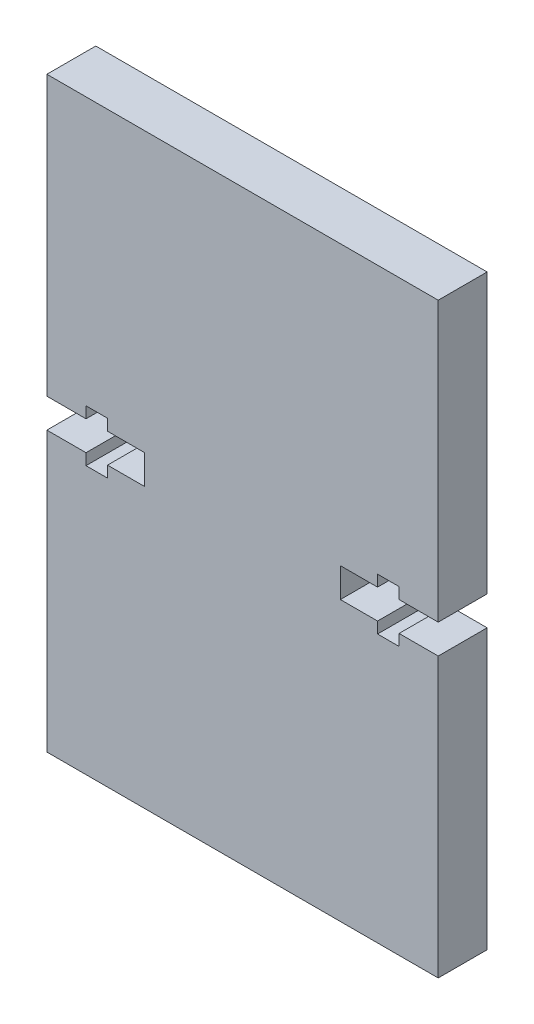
ISO-10303-21;
HEADER;
FILE_DESCRIPTION(('STEP AP214'),'2;1');
FILE_NAME('part.step','',(''),(''),'','','');
FILE_SCHEMA(('AUTOMOTIVE_DESIGN { 1 0 10303 214 1 1 1 1 }'));
ENDSEC;
DATA;
#1=APPLICATION_CONTEXT('core data for automotive mechanical design processes');
#2=APPLICATION_PROTOCOL_DEFINITION('international standard','automotive_design',2000,#1);
#3=PRODUCT_CONTEXT('',#1,'mechanical');
#4=PRODUCT('Part','Part','',(#3));
#5=PRODUCT_RELATED_PRODUCT_CATEGORY('part','',(#4));
#6=PRODUCT_DEFINITION_FORMATION('','',#4);
#7=PRODUCT_DEFINITION_CONTEXT('part definition',#1,'design');
#8=PRODUCT_DEFINITION('design','',#6,#7);
#9=PRODUCT_DEFINITION_SHAPE('','',#8);
#10=(LENGTH_UNIT() NAMED_UNIT(*) SI_UNIT(.MILLI.,.METRE.));
#11=(NAMED_UNIT(*) PLANE_ANGLE_UNIT() SI_UNIT($,.RADIAN.));
#12=(NAMED_UNIT(*) SI_UNIT($,.STERADIAN.) SOLID_ANGLE_UNIT());
#13=UNCERTAINTY_MEASURE_WITH_UNIT(LENGTH_MEASURE(1.E-05),#10,'distance_accuracy_value','');
#14=(GEOMETRIC_REPRESENTATION_CONTEXT(3) GLOBAL_UNCERTAINTY_ASSIGNED_CONTEXT((#13)) GLOBAL_UNIT_ASSIGNED_CONTEXT((#10,
#11,#12)) REPRESENTATION_CONTEXT('',''));
#15=CARTESIAN_POINT('',(0.,0.,0.));
#16=DIRECTION('',(0.,0.,1.));
#17=DIRECTION('',(1.,0.,0.));
#18=AXIS2_PLACEMENT_3D('',#15,#16,#17);
#19=CARTESIAN_POINT('',(-13.7999999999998,0.,10.));
#20=DIRECTION('',(1.,0.,0.));
#21=DIRECTION('',(0.,0.,-1.));
#22=AXIS2_PLACEMENT_3D('',#19,#20,#21);
#23=PLANE('',#22);
#24=DIRECTION('',(0.,0.,1.));
#25=VECTOR('',#24,1.);
#26=CARTESIAN_POINT('',(-13.7999999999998,2.64999999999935,10.));
#27=LINE('',#26,#25);
#28=CARTESIAN_POINT('',(-13.7999999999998,2.64999999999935,5.));
#29=VERTEX_POINT('',#28);
#30=CARTESIAN_POINT('',(-13.7999999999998,2.64999999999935,0.));
#31=VERTEX_POINT('',#30);
#32=EDGE_CURVE('E206',#29,#31,#27,.F.);
#33=ORIENTED_EDGE('',*,*,#32,.T.);
#34=DIRECTION('',(0.,1.,0.));
#35=VECTOR('',#34,1.);
#36=CARTESIAN_POINT('',(-13.7999999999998,0.,0.));
#37=LINE('',#36,#35);
#38=CARTESIAN_POINT('',(-13.7999999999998,1.49999999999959,0.));
#39=VERTEX_POINT('',#38);
#40=EDGE_CURVE('E20',#39,#31,#37,.T.);
#41=ORIENTED_EDGE('',*,*,#40,.F.);
#42=DIRECTION('',(0.,0.,1.));
#43=VECTOR('',#42,1.);
#44=CARTESIAN_POINT('',(-13.7999999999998,1.49999999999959,10.));
#45=LINE('',#44,#43);
#46=CARTESIAN_POINT('',(-13.7999999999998,1.49999999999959,5.));
#47=VERTEX_POINT('',#46);
#48=EDGE_CURVE('E220',#39,#47,#45,.T.);
#49=ORIENTED_EDGE('',*,*,#48,.T.);
#50=DIRECTION('',(0.,1.,0.));
#51=VECTOR('',#50,1.);
#52=CARTESIAN_POINT('',(-13.7999999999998,0.,5.));
#53=LINE('',#52,#51);
#54=EDGE_CURVE('E218',#29,#47,#53,.F.);
#55=ORIENTED_EDGE('',*,*,#54,.F.);
#56=EDGE_LOOP('',(#33,#41,#49,#55));
#57=FACE_BOUND('',#56,.T.);
#58=ADVANCED_FACE('F17',(#57),#23,.F.);
#59=CARTESIAN_POINT('',(-13.7999999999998,-1.50000000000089,10.));
#60=DIRECTION('',(1.,0.,0.));
#61=DIRECTION('',(0.,0.,-1.));
#62=AXIS2_PLACEMENT_3D('',#59,#60,#61);
#63=PLANE('',#62);
#64=DIRECTION('',(0.,0.,1.));
#65=VECTOR('',#64,1.);
#66=CARTESIAN_POINT('',(-13.7999999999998,-1.50000000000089,10.));
#67=LINE('',#66,#65);
#68=CARTESIAN_POINT('',(-13.7999999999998,-1.50000000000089,5.));
#69=VERTEX_POINT('',#68);
#70=CARTESIAN_POINT('',(-13.7999999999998,-1.50000000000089,0.));
#71=VERTEX_POINT('',#70);
#72=EDGE_CURVE('E270',#69,#71,#67,.F.);
#73=ORIENTED_EDGE('',*,*,#72,.T.);
#74=DIRECTION('',(0.,1.,0.));
#75=VECTOR('',#74,1.);
#76=CARTESIAN_POINT('',(-13.7999999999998,-1.50000000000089,0.));
#77=LINE('',#76,#75);
#78=CARTESIAN_POINT('',(-13.7999999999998,-2.65000000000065,0.));
#79=VERTEX_POINT('',#78);
#80=EDGE_CURVE('E252',#79,#71,#77,.T.);
#81=ORIENTED_EDGE('',*,*,#80,.F.);
#82=DIRECTION('',(0.,0.,1.));
#83=VECTOR('',#82,1.);
#84=CARTESIAN_POINT('',(-13.7999999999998,-2.65000000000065,10.));
#85=LINE('',#84,#83);
#86=CARTESIAN_POINT('',(-13.7999999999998,-2.65000000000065,5.));
#87=VERTEX_POINT('',#86);
#88=EDGE_CURVE('E281',#79,#87,#85,.T.);
#89=ORIENTED_EDGE('',*,*,#88,.T.);
#90=DIRECTION('',(0.,1.,0.));
#91=VECTOR('',#90,1.);
#92=CARTESIAN_POINT('',(-13.7999999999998,0.,5.));
#93=LINE('',#92,#91);
#94=EDGE_CURVE('E222',#69,#87,#93,.F.);
#95=ORIENTED_EDGE('',*,*,#94,.F.);
#96=EDGE_LOOP('',(#73,#81,#89,#95));
#97=FACE_BOUND('',#96,.T.);
#98=ADVANCED_FACE('F512',(#97),#63,.F.);
#99=CARTESIAN_POINT('',(-15.9999999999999,-2.65000000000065,10.));
#100=DIRECTION('',(-1.,1.02574953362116E-13,0.));
#101=DIRECTION('',(-1.02574953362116E-13,-1.,0.));
#102=AXIS2_PLACEMENT_3D('',#99,#100,#101);
#103=PLANE('',#102);
#104=DIRECTION('',(0.,0.,1.));
#105=VECTOR('',#104,1.);
#106=CARTESIAN_POINT('',(-15.9999999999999,-2.65000000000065,10.));
#107=LINE('',#106,#105);
#108=CARTESIAN_POINT('',(-15.9999999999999,-2.65000000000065,5.));
#109=VERTEX_POINT('',#108);
#110=CARTESIAN_POINT('',(-15.9999999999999,-2.65000000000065,0.));
#111=VERTEX_POINT('',#110);
#112=EDGE_CURVE('E278',#109,#111,#107,.F.);
#113=ORIENTED_EDGE('',*,*,#112,.T.);
#114=DIRECTION('',(-1.02574953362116E-13,-1.,0.));
#115=VECTOR('',#114,1.);
#116=CARTESIAN_POINT('',(-15.9999999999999,-2.65000000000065,0.));
#117=LINE('',#116,#115);
#118=CARTESIAN_POINT('',(-15.9999999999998,-1.50000000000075,0.));
#119=VERTEX_POINT('',#118);
#120=EDGE_CURVE('E251',#119,#111,#117,.T.);
#121=ORIENTED_EDGE('',*,*,#120,.F.);
#122=DIRECTION('',(0.,0.,1.));
#123=VECTOR('',#122,1.);
#124=CARTESIAN_POINT('',(-15.9999999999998,-1.50000000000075,10.));
#125=LINE('',#124,#123);
#126=CARTESIAN_POINT('',(-15.9999999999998,-1.50000000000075,5.));
#127=VERTEX_POINT('',#126);
#128=EDGE_CURVE('E287',#119,#127,#125,.T.);
#129=ORIENTED_EDGE('',*,*,#128,.T.);
#130=DIRECTION('',(0.,1.,0.));
#131=VECTOR('',#130,1.);
#132=CARTESIAN_POINT('',(-15.9999999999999,0.,5.));
#133=LINE('',#132,#131);
#134=EDGE_CURVE('E238',#109,#127,#133,.T.);
#135=ORIENTED_EDGE('',*,*,#134,.F.);
#136=EDGE_LOOP('',(#113,#121,#129,#135));
#137=FACE_BOUND('',#136,.T.);
#138=ADVANCED_FACE('F505',(#137),#103,.F.);
#139=CARTESIAN_POINT('',(15.9999999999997,1.54465812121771E-12,10.));
#140=DIRECTION('',(-1.,0.,0.));
#141=DIRECTION('',(0.,-1.,0.));
#142=AXIS2_PLACEMENT_3D('',#139,#140,#141);
#143=PLANE('',#142);
#144=DIRECTION('',(0.,0.,1.));
#145=VECTOR('',#144,1.);
#146=CARTESIAN_POINT('',(16.,-2.65000000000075,10.));
#147=LINE('',#146,#145);
#148=CARTESIAN_POINT('',(15.9999999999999,-2.65000000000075,5.));
#149=VERTEX_POINT('',#148);
#150=CARTESIAN_POINT('',(15.9999999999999,-2.65000000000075,0.));
#151=VERTEX_POINT('',#150);
#152=EDGE_CURVE('E314',#149,#151,#147,.F.);
#153=ORIENTED_EDGE('',*,*,#152,.F.);
#154=DIRECTION('',(0.,1.,0.));
#155=VECTOR('',#154,1.);
#156=CARTESIAN_POINT('',(15.9999999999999,0.,5.));
#157=LINE('',#156,#155);
#158=CARTESIAN_POINT('',(15.9999999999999,-1.50000000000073,5.));
#159=VERTEX_POINT('',#158);
#160=EDGE_CURVE('E236',#159,#149,#157,.F.);
#161=ORIENTED_EDGE('',*,*,#160,.F.);
#162=DIRECTION('',(0.,0.,1.));
#163=VECTOR('',#162,1.);
#164=CARTESIAN_POINT('',(15.9999999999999,-1.50000000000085,10.));
#165=LINE('',#164,#163);
#166=CARTESIAN_POINT('',(15.9999999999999,-1.50000000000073,0.));
#167=VERTEX_POINT('',#166);
#168=EDGE_CURVE('E309',#167,#159,#165,.T.);
#169=ORIENTED_EDGE('',*,*,#168,.F.);
#170=DIRECTION('',(0.,-1.,0.));
#171=VECTOR('',#170,1.);
#172=CARTESIAN_POINT('',(15.9999999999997,1.54465812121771E-12,0.));
#173=LINE('',#172,#171);
#174=EDGE_CURVE('E249',#167,#151,#173,.T.);
#175=ORIENTED_EDGE('',*,*,#174,.T.);
#176=EDGE_LOOP('',(#153,#161,#169,#175));
#177=FACE_BOUND('',#176,.T.);
#178=ADVANCED_FACE('F480',(#177),#143,.T.);
#179=CARTESIAN_POINT('',(13.8,0.,10.));
#180=DIRECTION('',(1.,0.,0.));
#181=DIRECTION('',(0.,1.,0.));
#182=AXIS2_PLACEMENT_3D('',#179,#180,#181);
#183=PLANE('',#182);
#184=DIRECTION('',(0.,0.,1.));
#185=VECTOR('',#184,1.);
#186=CARTESIAN_POINT('',(13.7999999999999,-1.50000000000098,10.));
#187=LINE('',#186,#185);
#188=CARTESIAN_POINT('',(13.7999999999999,-1.50000000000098,5.));
#189=VERTEX_POINT('',#188);
#190=CARTESIAN_POINT('',(13.7999999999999,-1.50000000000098,0.));
#191=VERTEX_POINT('',#190);
#192=EDGE_CURVE('E322',#189,#191,#187,.F.);
#193=ORIENTED_EDGE('',*,*,#192,.F.);
#194=DIRECTION('',(0.,1.,0.));
#195=VECTOR('',#194,1.);
#196=CARTESIAN_POINT('',(13.7999999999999,0.,5.));
#197=LINE('',#196,#195);
#198=CARTESIAN_POINT('',(13.7999999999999,-2.65000000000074,5.));
#199=VERTEX_POINT('',#198);
#200=EDGE_CURVE('E234',#199,#189,#197,.T.);
#201=ORIENTED_EDGE('',*,*,#200,.F.);
#202=DIRECTION('',(0.,0.,1.));
#203=VECTOR('',#202,1.);
#204=CARTESIAN_POINT('',(13.7999999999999,-2.65000000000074,10.));
#205=LINE('',#204,#203);
#206=CARTESIAN_POINT('',(13.7999999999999,-2.65000000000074,0.));
#207=VERTEX_POINT('',#206);
#208=EDGE_CURVE('E317',#207,#199,#205,.T.);
#209=ORIENTED_EDGE('',*,*,#208,.F.);
#210=DIRECTION('',(0.,1.,0.));
#211=VECTOR('',#210,1.);
#212=CARTESIAN_POINT('',(13.8,0.,0.));
#213=LINE('',#212,#211);
#214=EDGE_CURVE('E247',#207,#191,#213,.T.);
#215=ORIENTED_EDGE('',*,*,#214,.T.);
#216=EDGE_LOOP('',(#193,#201,#209,#215));
#217=FACE_BOUND('',#216,.T.);
#218=ADVANCED_FACE('F473',(#217),#183,.T.);
#219=CARTESIAN_POINT('',(13.8,0.,10.));
#220=DIRECTION('',(1.,0.,0.));
#221=DIRECTION('',(0.,1.,0.));
#222=AXIS2_PLACEMENT_3D('',#219,#220,#221);
#223=PLANE('',#222);
#224=DIRECTION('',(0.,0.,1.));
#225=VECTOR('',#224,1.);
#226=CARTESIAN_POINT('',(13.8,2.64999999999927,10.));
#227=LINE('',#226,#225);
#228=CARTESIAN_POINT('',(13.8,2.64999999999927,5.));
#229=VERTEX_POINT('',#228);
#230=CARTESIAN_POINT('',(13.8,2.64999999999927,0.));
#231=VERTEX_POINT('',#230);
#232=EDGE_CURVE('E340',#229,#231,#227,.F.);
#233=ORIENTED_EDGE('',*,*,#232,.F.);
#234=DIRECTION('',(0.,1.,0.));
#235=VECTOR('',#234,1.);
#236=CARTESIAN_POINT('',(13.8,0.,5.));
#237=LINE('',#236,#235);
#238=CARTESIAN_POINT('',(13.8,1.49999999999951,5.));
#239=VERTEX_POINT('',#238);
#240=EDGE_CURVE('E232',#239,#229,#237,.T.);
#241=ORIENTED_EDGE('',*,*,#240,.F.);
#242=DIRECTION('',(0.,0.,1.));
#243=VECTOR('',#242,1.);
#244=CARTESIAN_POINT('',(13.8,1.49999999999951,10.));
#245=LINE('',#244,#243);
#246=CARTESIAN_POINT('',(13.8,1.49999999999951,0.));
#247=VERTEX_POINT('',#246);
#248=EDGE_CURVE('E335',#247,#239,#245,.T.);
#249=ORIENTED_EDGE('',*,*,#248,.F.);
#250=DIRECTION('',(0.,1.,0.));
#251=VECTOR('',#250,1.);
#252=CARTESIAN_POINT('',(13.8,0.,0.));
#253=LINE('',#252,#251);
#254=EDGE_CURVE('E245',#247,#231,#253,.T.);
#255=ORIENTED_EDGE('',*,*,#254,.T.);
#256=EDGE_LOOP('',(#233,#241,#249,#255));
#257=FACE_BOUND('',#256,.T.);
#258=ADVANCED_FACE('F456',(#257),#223,.T.);
#259=CARTESIAN_POINT('',(15.9999999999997,-1.73774038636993E-12,10.));
#260=DIRECTION('',(-1.,1.08608774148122E-13,0.));
#261=DIRECTION('',(-1.08608774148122E-13,-1.,0.));
#262=AXIS2_PLACEMENT_3D('',#259,#260,#261);
#263=PLANE('',#262);
#264=DIRECTION('',(0.,0.,1.));
#265=VECTOR('',#264,1.);
#266=CARTESIAN_POINT('',(15.9999999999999,1.49999999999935,10.));
#267=LINE('',#266,#265);
#268=CARTESIAN_POINT('',(15.9999999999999,1.49999999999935,5.));
#269=VERTEX_POINT('',#268);
#270=CARTESIAN_POINT('',(15.9999999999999,1.49999999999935,0.));
#271=VERTEX_POINT('',#270);
#272=EDGE_CURVE('E348',#269,#271,#267,.F.);
#273=ORIENTED_EDGE('',*,*,#272,.F.);
#274=DIRECTION('',(0.,1.,0.));
#275=VECTOR('',#274,1.);
#276=CARTESIAN_POINT('',(16.,0.,5.));
#277=LINE('',#276,#275);
#278=CARTESIAN_POINT('',(16.,2.64999999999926,5.));
#279=VERTEX_POINT('',#278);
#280=EDGE_CURVE('E215',#279,#269,#277,.F.);
#281=ORIENTED_EDGE('',*,*,#280,.F.);
#282=DIRECTION('',(0.,0.,1.));
#283=VECTOR('',#282,1.);
#284=CARTESIAN_POINT('',(16.,2.64999999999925,10.));
#285=LINE('',#284,#283);
#286=CARTESIAN_POINT('',(16.,2.64999999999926,0.));
#287=VERTEX_POINT('',#286);
#288=EDGE_CURVE('E343',#287,#279,#285,.T.);
#289=ORIENTED_EDGE('',*,*,#288,.F.);
#290=DIRECTION('',(-1.08608774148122E-13,-1.,0.));
#291=VECTOR('',#290,1.);
#292=CARTESIAN_POINT('',(15.9999999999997,-1.73774038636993E-12,0.));
#293=LINE('',#292,#291);
#294=EDGE_CURVE('E243',#287,#271,#293,.T.);
#295=ORIENTED_EDGE('',*,*,#294,.T.);
#296=EDGE_LOOP('',(#273,#281,#289,#295));
#297=FACE_BOUND('',#296,.T.);
#298=ADVANCED_FACE('F445',(#297),#263,.T.);
#299=CARTESIAN_POINT('',(-15.9999999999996,-1.64119925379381E-12,10.));
#300=DIRECTION('',(-1.,-1.02574953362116E-13,0.));
#301=DIRECTION('',(1.02574953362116E-13,-1.,0.));
#302=AXIS2_PLACEMENT_3D('',#299,#300,#301);
#303=PLANE('',#302);
#304=DIRECTION('',(0.,0.,1.));
#305=VECTOR('',#304,1.);
#306=CARTESIAN_POINT('',(-15.9999999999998,1.49999999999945,10.));
#307=LINE('',#306,#305);
#308=CARTESIAN_POINT('',(-15.9999999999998,1.49999999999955,5.));
#309=VERTEX_POINT('',#308);
#310=CARTESIAN_POINT('',(-15.9999999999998,1.49999999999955,0.));
#311=VERTEX_POINT('',#310);
#312=EDGE_CURVE('E369',#309,#311,#307,.F.);
#313=ORIENTED_EDGE('',*,*,#312,.T.);
#314=DIRECTION('',(1.02574953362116E-13,-1.,0.));
#315=VECTOR('',#314,1.);
#316=CARTESIAN_POINT('',(-15.9999999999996,-1.64119925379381E-12,0.));
#317=LINE('',#316,#315);
#318=CARTESIAN_POINT('',(-15.9999999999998,2.64999999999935,0.));
#319=VERTEX_POINT('',#318);
#320=EDGE_CURVE('E35',#319,#311,#317,.T.);
#321=ORIENTED_EDGE('',*,*,#320,.F.);
#322=DIRECTION('',(0.,0.,1.));
#323=VECTOR('',#322,1.);
#324=CARTESIAN_POINT('',(-15.9999999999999,2.64999999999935,10.));
#325=LINE('',#324,#323);
#326=CARTESIAN_POINT('',(-15.9999999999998,2.64999999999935,5.));
#327=VERTEX_POINT('',#326);
#328=EDGE_CURVE('E214',#319,#327,#325,.T.);
#329=ORIENTED_EDGE('',*,*,#328,.T.);
#330=DIRECTION('',(0.,1.,0.));
#331=VECTOR('',#330,1.);
#332=CARTESIAN_POINT('',(-15.9999999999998,0.,5.));
#333=LINE('',#332,#331);
#334=EDGE_CURVE('E200',#309,#327,#333,.T.);
#335=ORIENTED_EDGE('',*,*,#334,.F.);
#336=EDGE_LOOP('',(#313,#321,#329,#335));
#337=FACE_BOUND('',#336,.T.);
#338=ADVANCED_FACE('F694',(#337),#303,.F.);
#339=CARTESIAN_POINT('',(0.,0.,5.));
#340=DIRECTION('',(0.,0.,1.));
#341=DIRECTION('',(1.,0.,0.));
#342=AXIS2_PLACEMENT_3D('',#339,#340,#341);
#343=PLANE('',#342);
#344=DIRECTION('',(1.,0.,0.));
#345=VECTOR('',#344,1.);
#346=CARTESIAN_POINT('',(-20.0000000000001,30.,5.));
#347=LINE('',#346,#345);
#348=CARTESIAN_POINT('',(19.9999999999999,30.,5.));
#349=VERTEX_POINT('',#348);
#350=CARTESIAN_POINT('',(-20.0000000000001,30.,5.));
#351=VERTEX_POINT('',#350);
#352=EDGE_CURVE('E362',#349,#351,#347,.F.);
#353=ORIENTED_EDGE('',*,*,#352,.T.);
#354=DIRECTION('',(0.,1.,0.));
#355=VECTOR('',#354,1.);
#356=CARTESIAN_POINT('',(-20.0000000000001,30.,5.));
#357=LINE('',#356,#355);
#358=CARTESIAN_POINT('',(-20.0000000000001,1.49999999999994,5.));
#359=VERTEX_POINT('',#358);
#360=EDGE_CURVE('E367',#351,#359,#357,.F.);
#361=ORIENTED_EDGE('',*,*,#360,.T.);
#362=DIRECTION('',(-1.,1.97541635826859E-13,0.));
#363=VECTOR('',#362,1.);
#364=CARTESIAN_POINT('',(2.96312453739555E-13,1.49999999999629,5.));
#365=LINE('',#364,#363);
#366=EDGE_CURVE('E374',#359,#309,#365,.F.);
#367=ORIENTED_EDGE('',*,*,#366,.T.);
#368=ORIENTED_EDGE('',*,*,#334,.T.);
#369=DIRECTION('',(1.,0.,0.));
#370=VECTOR('',#369,1.);
#371=CARTESIAN_POINT('',(0.,2.64999999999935,5.));
#372=LINE('',#371,#370);
#373=EDGE_CURVE('E210',#327,#29,#372,.T.);
#374=ORIENTED_EDGE('',*,*,#373,.T.);
#375=ORIENTED_EDGE('',*,*,#54,.T.);
#376=DIRECTION('',(1.,0.,0.));
#377=VECTOR('',#376,1.);
#378=CARTESIAN_POINT('',(0.,1.49999999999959,5.));
#379=LINE('',#378,#377);
#380=CARTESIAN_POINT('',(-9.99999999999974,1.49999999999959,5.));
#381=VERTEX_POINT('',#380);
#382=EDGE_CURVE('E226',#47,#381,#379,.T.);
#383=ORIENTED_EDGE('',*,*,#382,.T.);
#384=DIRECTION('',(0.,1.,0.));
#385=VECTOR('',#384,1.);
#386=CARTESIAN_POINT('',(-9.99999999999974,0.,5.));
#387=LINE('',#386,#385);
#388=CARTESIAN_POINT('',(-9.99999999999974,-1.50000000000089,5.));
#389=VERTEX_POINT('',#388);
#390=EDGE_CURVE('E266',#381,#389,#387,.F.);
#391=ORIENTED_EDGE('',*,*,#390,.T.);
#392=DIRECTION('',(1.,0.,0.));
#393=VECTOR('',#392,1.);
#394=CARTESIAN_POINT('',(-9.99999999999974,-1.50000000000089,5.));
#395=LINE('',#394,#393);
#396=EDGE_CURVE('E275',#389,#69,#395,.F.);
#397=ORIENTED_EDGE('',*,*,#396,.T.);
#398=ORIENTED_EDGE('',*,*,#94,.T.);
#399=DIRECTION('',(1.,0.,0.));
#400=VECTOR('',#399,1.);
#401=CARTESIAN_POINT('',(-13.7999999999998,-2.65000000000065,5.));
#402=LINE('',#401,#400);
#403=EDGE_CURVE('E284',#87,#109,#402,.F.);
#404=ORIENTED_EDGE('',*,*,#403,.T.);
#405=ORIENTED_EDGE('',*,*,#134,.T.);
#406=DIRECTION('',(1.,-1.28261117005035E-13,0.));
#407=VECTOR('',#406,1.);
#408=CARTESIAN_POINT('',(-15.9999999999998,-1.50000000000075,5.));
#409=LINE('',#408,#407);
#410=CARTESIAN_POINT('',(-19.9999999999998,-1.50000000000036,5.));
#411=VERTEX_POINT('',#410);
#412=EDGE_CURVE('E290',#127,#411,#409,.F.);
#413=ORIENTED_EDGE('',*,*,#412,.T.);
#414=DIRECTION('',(0.,1.,0.));
#415=VECTOR('',#414,1.);
#416=CARTESIAN_POINT('',(-20.0000000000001,30.,5.));
#417=LINE('',#416,#415);
#418=CARTESIAN_POINT('',(-20.,-30.,5.));
#419=VERTEX_POINT('',#418);
#420=EDGE_CURVE('E295',#411,#419,#417,.F.);
#421=ORIENTED_EDGE('',*,*,#420,.T.);
#422=DIRECTION('',(1.,0.,0.));
#423=VECTOR('',#422,1.);
#424=CARTESIAN_POINT('',(-20.,-30.,5.));
#425=LINE('',#424,#423);
#426=CARTESIAN_POINT('',(20.,-30.,5.));
#427=VERTEX_POINT('',#426);
#428=EDGE_CURVE('E300',#419,#427,#425,.T.);
#429=ORIENTED_EDGE('',*,*,#428,.T.);
#430=DIRECTION('',(0.,-1.,0.));
#431=VECTOR('',#430,1.);
#432=CARTESIAN_POINT('',(19.9999999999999,30.,5.));
#433=LINE('',#432,#431);
#434=CARTESIAN_POINT('',(20.,-1.50000000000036,5.));
#435=VERTEX_POINT('',#434);
#436=EDGE_CURVE('E305',#427,#435,#433,.F.);
#437=ORIENTED_EDGE('',*,*,#436,.T.);
#438=DIRECTION('',(-1.,-1.23056946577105E-13,0.));
#439=VECTOR('',#438,1.);
#440=CARTESIAN_POINT('',(1.84585419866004E-13,-1.50000000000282,5.));
#441=LINE('',#440,#439);
#442=EDGE_CURVE('E311',#159,#435,#441,.F.);
#443=ORIENTED_EDGE('',*,*,#442,.F.);
#444=ORIENTED_EDGE('',*,*,#160,.T.);
#445=DIRECTION('',(-1.,0.,0.));
#446=VECTOR('',#445,1.);
#447=CARTESIAN_POINT('',(0.,-2.65000000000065,5.));
#448=LINE('',#447,#446);
#449=EDGE_CURVE('E319',#199,#149,#448,.F.);
#450=ORIENTED_EDGE('',*,*,#449,.F.);
#451=ORIENTED_EDGE('',*,*,#200,.T.);
#452=DIRECTION('',(-1.,0.,0.));
#453=VECTOR('',#452,1.);
#454=CARTESIAN_POINT('',(0.,-1.50000000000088,5.));
#455=LINE('',#454,#453);
#456=CARTESIAN_POINT('',(9.99999999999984,-1.50000000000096,5.));
#457=VERTEX_POINT('',#456);
#458=EDGE_CURVE('E325',#457,#189,#455,.F.);
#459=ORIENTED_EDGE('',*,*,#458,.F.);
#460=DIRECTION('',(0.,1.,0.));
#461=VECTOR('',#460,1.);
#462=CARTESIAN_POINT('',(9.99999999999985,0.,5.));
#463=LINE('',#462,#461);
#464=CARTESIAN_POINT('',(9.99999999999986,1.49999999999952,5.));
#465=VERTEX_POINT('',#464);
#466=EDGE_CURVE('E330',#465,#457,#463,.F.);
#467=ORIENTED_EDGE('',*,*,#466,.F.);
#468=DIRECTION('',(1.,0.,0.));
#469=VECTOR('',#468,1.);
#470=CARTESIAN_POINT('',(0.,1.49999999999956,5.));
#471=LINE('',#470,#469);
#472=EDGE_CURVE('E337',#239,#465,#471,.F.);
#473=ORIENTED_EDGE('',*,*,#472,.F.);
#474=ORIENTED_EDGE('',*,*,#240,.T.);
#475=DIRECTION('',(1.,0.,0.));
#476=VECTOR('',#475,1.);
#477=CARTESIAN_POINT('',(0.,2.64999999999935,5.));
#478=LINE('',#477,#476);
#479=EDGE_CURVE('E345',#279,#229,#478,.F.);
#480=ORIENTED_EDGE('',*,*,#479,.F.);
#481=ORIENTED_EDGE('',*,*,#280,.T.);
#482=DIRECTION('',(1.,1.90602741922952E-13,0.));
#483=VECTOR('',#482,1.);
#484=CARTESIAN_POINT('',(-2.85904112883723E-13,1.4999999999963,5.));
#485=LINE('',#484,#483);
#486=CARTESIAN_POINT('',(20.,1.49999999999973,5.));
#487=VERTEX_POINT('',#486);
#488=EDGE_CURVE('E351',#487,#269,#485,.F.);
#489=ORIENTED_EDGE('',*,*,#488,.F.);
#490=DIRECTION('',(0.,-1.,0.));
#491=VECTOR('',#490,1.);
#492=CARTESIAN_POINT('',(19.9999999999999,30.,5.));
#493=LINE('',#492,#491);
#494=EDGE_CURVE('E354',#487,#349,#493,.F.);
#495=ORIENTED_EDGE('',*,*,#494,.T.);
#496=EDGE_LOOP('',(#353,#361,#367,#368,#374,#375,#383,#391,#397,#398,#404,#405,#413,#421,#429,
#437,#443,#444,#450,#451,#459,#467,#473,#474,#480,#481,#489,#495));
#497=FACE_BOUND('',#496,.T.);
#498=ADVANCED_FACE('F224',(#497),#343,.T.);
#499=CARTESIAN_POINT('',(0.,2.64999999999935,10.));
#500=DIRECTION('',(0.,1.,0.));
#501=DIRECTION('',(0.,0.,1.));
#502=AXIS2_PLACEMENT_3D('',#499,#500,#501);
#503=PLANE('',#502);
#504=ORIENTED_EDGE('',*,*,#328,.F.);
#505=DIRECTION('',(1.,0.,0.));
#506=VECTOR('',#505,1.);
#507=CARTESIAN_POINT('',(0.,2.64999999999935,0.));
#508=LINE('',#507,#506);
#509=EDGE_CURVE('E212',#319,#31,#508,.T.);
#510=ORIENTED_EDGE('',*,*,#509,.T.);
#511=ORIENTED_EDGE('',*,*,#32,.F.);
#512=ORIENTED_EDGE('',*,*,#373,.F.);
#513=EDGE_LOOP('',(#504,#510,#511,#512));
#514=FACE_BOUND('',#513,.T.);
#515=ADVANCED_FACE('F209',(#514),#503,.F.);
#516=CARTESIAN_POINT('',(0.,1.49999999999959,10.));
#517=DIRECTION('',(0.,1.,0.));
#518=DIRECTION('',(0.,0.,1.));
#519=AXIS2_PLACEMENT_3D('',#516,#517,#518);
#520=PLANE('',#519);
#521=ORIENTED_EDGE('',*,*,#48,.F.);
#522=DIRECTION('',(1.,0.,0.));
#523=VECTOR('',#522,1.);
#524=CARTESIAN_POINT('',(0.,1.49999999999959,0.));
#525=LINE('',#524,#523);
#526=CARTESIAN_POINT('',(-9.99999999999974,1.49999999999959,0.));
#527=VERTEX_POINT('',#526);
#528=EDGE_CURVE('E260',#39,#527,#525,.T.);
#529=ORIENTED_EDGE('',*,*,#528,.T.);
#530=DIRECTION('',(0.,0.,-1.));
#531=VECTOR('',#530,1.);
#532=CARTESIAN_POINT('',(-9.99999999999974,1.49999999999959,10.));
#533=LINE('',#532,#531);
#534=EDGE_CURVE('E264',#527,#381,#533,.F.);
#535=ORIENTED_EDGE('',*,*,#534,.T.);
#536=ORIENTED_EDGE('',*,*,#382,.F.);
#537=EDGE_LOOP('',(#521,#529,#535,#536));
#538=FACE_BOUND('',#537,.T.);
#539=ADVANCED_FACE('F262',(#538),#520,.F.);
#540=CARTESIAN_POINT('',(-9.99999999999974,0.,10.));
#541=DIRECTION('',(1.,0.,0.));
#542=DIRECTION('',(0.,0.,-1.));
#543=AXIS2_PLACEMENT_3D('',#540,#541,#542);
#544=PLANE('',#543);
#545=ORIENTED_EDGE('',*,*,#534,.F.);
#546=DIRECTION('',(0.,1.,0.));
#547=VECTOR('',#546,1.);
#548=CARTESIAN_POINT('',(-9.99999999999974,0.,0.));
#549=LINE('',#548,#547);
#550=CARTESIAN_POINT('',(-9.99999999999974,-1.50000000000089,0.));
#551=VERTEX_POINT('',#550);
#552=EDGE_CURVE('E378',#527,#551,#549,.F.);
#553=ORIENTED_EDGE('',*,*,#552,.T.);
#554=DIRECTION('',(0.,0.,1.));
#555=VECTOR('',#554,1.);
#556=CARTESIAN_POINT('',(-9.99999999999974,-1.50000000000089,10.));
#557=LINE('',#556,#555);
#558=EDGE_CURVE('E272',#551,#389,#557,.T.);
#559=ORIENTED_EDGE('',*,*,#558,.T.);
#560=ORIENTED_EDGE('',*,*,#390,.F.);
#561=EDGE_LOOP('',(#545,#553,#559,#560));
#562=FACE_BOUND('',#561,.T.);
#563=ADVANCED_FACE('F517',(#562),#544,.F.);
#564=CARTESIAN_POINT('',(-9.99999999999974,-1.50000000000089,10.));
#565=DIRECTION('',(0.,-1.,0.));
#566=DIRECTION('',(1.,0.,0.));
#567=AXIS2_PLACEMENT_3D('',#564,#565,#566);
#568=PLANE('',#567);
#569=ORIENTED_EDGE('',*,*,#558,.F.);
#570=DIRECTION('',(1.,0.,0.));
#571=VECTOR('',#570,1.);
#572=CARTESIAN_POINT('',(0.,-1.50000000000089,0.));
#573=LINE('',#572,#571);
#574=EDGE_CURVE('E381',#551,#71,#573,.F.);
#575=ORIENTED_EDGE('',*,*,#574,.T.);
#576=ORIENTED_EDGE('',*,*,#72,.F.);
#577=ORIENTED_EDGE('',*,*,#396,.F.);
#578=EDGE_LOOP('',(#569,#575,#576,#577));
#579=FACE_BOUND('',#578,.T.);
#580=ADVANCED_FACE('F515',(#579),#568,.F.);
#581=CARTESIAN_POINT('',(-13.7999999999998,-2.65000000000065,10.));
#582=DIRECTION('',(0.,-1.,0.));
#583=DIRECTION('',(1.,0.,0.));
#584=AXIS2_PLACEMENT_3D('',#581,#582,#583);
#585=PLANE('',#584);
#586=ORIENTED_EDGE('',*,*,#88,.F.);
#587=DIRECTION('',(1.,0.,0.));
#588=VECTOR('',#587,1.);
#589=CARTESIAN_POINT('',(0.,-2.65000000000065,0.));
#590=LINE('',#589,#588);
#591=EDGE_CURVE('E384',#79,#111,#590,.F.);
#592=ORIENTED_EDGE('',*,*,#591,.T.);
#593=ORIENTED_EDGE('',*,*,#112,.F.);
#594=ORIENTED_EDGE('',*,*,#403,.F.);
#595=EDGE_LOOP('',(#586,#592,#593,#594));
#596=FACE_BOUND('',#595,.T.);
#597=ADVANCED_FACE('F509',(#596),#585,.F.);
#598=CARTESIAN_POINT('',(-15.9999999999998,-1.50000000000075,10.));
#599=DIRECTION('',(-1.28261117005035E-13,-1.,0.));
#600=DIRECTION('',(1.,-1.28261117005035E-13,0.));
#601=AXIS2_PLACEMENT_3D('',#598,#599,#600);
#602=PLANE('',#601);
#603=ORIENTED_EDGE('',*,*,#128,.F.);
#604=DIRECTION('',(1.,0.,0.));
#605=VECTOR('',#604,1.);
#606=CARTESIAN_POINT('',(0.,-1.50000000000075,0.));
#607=LINE('',#606,#605);
#608=CARTESIAN_POINT('',(-19.9999999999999,-1.50000000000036,0.));
#609=VERTEX_POINT('',#608);
#610=EDGE_CURVE('E387',#119,#609,#607,.F.);
#611=ORIENTED_EDGE('',*,*,#610,.T.);
#612=DIRECTION('',(0.,0.,1.));
#613=VECTOR('',#612,1.);
#614=CARTESIAN_POINT('',(-20.,-1.50000000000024,5.));
#615=LINE('',#614,#613);
#616=EDGE_CURVE('E292',#609,#411,#615,.T.);
#617=ORIENTED_EDGE('',*,*,#616,.T.);
#618=ORIENTED_EDGE('',*,*,#412,.F.);
#619=EDGE_LOOP('',(#603,#611,#617,#618));
#620=FACE_BOUND('',#619,.T.);
#621=ADVANCED_FACE('F502',(#620),#602,.F.);
#622=CARTESIAN_POINT('',(-20.0000000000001,30.,5.));
#623=DIRECTION('',(1.,0.,0.));
#624=DIRECTION('',(0.,1.,0.));
#625=AXIS2_PLACEMENT_3D('',#622,#623,#624);
#626=PLANE('',#625);
#627=ORIENTED_EDGE('',*,*,#616,.F.);
#628=DIRECTION('',(0.,1.,0.));
#629=VECTOR('',#628,1.);
#630=CARTESIAN_POINT('',(-20.,0.,0.));
#631=LINE('',#630,#629);
#632=CARTESIAN_POINT('',(-20.,-30.,0.));
#633=VERTEX_POINT('',#632);
#634=EDGE_CURVE('E390',#609,#633,#631,.F.);
#635=ORIENTED_EDGE('',*,*,#634,.T.);
#636=DIRECTION('',(0.,0.,1.));
#637=VECTOR('',#636,1.);
#638=CARTESIAN_POINT('',(-20.,-30.,5.));
#639=LINE('',#638,#637);
#640=EDGE_CURVE('E297',#633,#419,#639,.T.);
#641=ORIENTED_EDGE('',*,*,#640,.T.);
#642=ORIENTED_EDGE('',*,*,#420,.F.);
#643=EDGE_LOOP('',(#627,#635,#641,#642));
#644=FACE_BOUND('',#643,.T.);
#645=ADVANCED_FACE('F497',(#644),#626,.F.);
#646=CARTESIAN_POINT('',(-20.,-30.,5.));
#647=DIRECTION('',(0.,1.,0.));
#648=DIRECTION('',(0.,0.,1.));
#649=AXIS2_PLACEMENT_3D('',#646,#647,#648);
#650=PLANE('',#649);
#651=DIRECTION('',(0.,0.,1.));
#652=VECTOR('',#651,1.);
#653=CARTESIAN_POINT('',(20.,-30.,5.));
#654=LINE('',#653,#652);
#655=CARTESIAN_POINT('',(20.,-30.,0.));
#656=VERTEX_POINT('',#655);
#657=EDGE_CURVE('E302',#656,#427,#654,.T.);
#658=ORIENTED_EDGE('',*,*,#657,.T.);
#659=ORIENTED_EDGE('',*,*,#428,.F.);
#660=ORIENTED_EDGE('',*,*,#640,.F.);
#661=DIRECTION('',(1.,0.,0.));
#662=VECTOR('',#661,1.);
#663=CARTESIAN_POINT('',(0.,-30.,0.));
#664=LINE('',#663,#662);
#665=EDGE_CURVE('E393',#633,#656,#664,.T.);
#666=ORIENTED_EDGE('',*,*,#665,.T.);
#667=EDGE_LOOP('',(#658,#659,#660,#666));
#668=FACE_BOUND('',#667,.T.);
#669=ADVANCED_FACE('F493',(#668),#650,.F.);
#670=CARTESIAN_POINT('',(19.9999999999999,30.,5.));
#671=DIRECTION('',(-1.,0.,0.));
#672=DIRECTION('',(0.,-1.,0.));
#673=AXIS2_PLACEMENT_3D('',#670,#671,#672);
#674=PLANE('',#673);
#675=ORIENTED_EDGE('',*,*,#436,.F.);
#676=ORIENTED_EDGE('',*,*,#657,.F.);
#677=DIRECTION('',(0.,1.,0.));
#678=VECTOR('',#677,1.);
#679=CARTESIAN_POINT('',(20.,0.,0.));
#680=LINE('',#679,#678);
#681=CARTESIAN_POINT('',(20.,-1.50000000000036,0.));
#682=VERTEX_POINT('',#681);
#683=EDGE_CURVE('E396',#656,#682,#680,.T.);
#684=ORIENTED_EDGE('',*,*,#683,.T.);
#685=DIRECTION('',(0.,0.,1.));
#686=VECTOR('',#685,1.);
#687=CARTESIAN_POINT('',(20.,-1.50000000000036,10.));
#688=LINE('',#687,#686);
#689=EDGE_CURVE('E307',#435,#682,#688,.F.);
#690=ORIENTED_EDGE('',*,*,#689,.F.);
#691=EDGE_LOOP('',(#675,#676,#684,#690));
#692=FACE_BOUND('',#691,.T.);
#693=ADVANCED_FACE('F490',(#692),#674,.F.);
#694=CARTESIAN_POINT('',(1.84585419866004E-13,-1.50000000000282,10.));
#695=DIRECTION('',(-1.23056946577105E-13,1.,0.));
#696=DIRECTION('',(-1.,-1.23056946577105E-13,0.));
#697=AXIS2_PLACEMENT_3D('',#694,#695,#696);
#698=PLANE('',#697);
#699=ORIENTED_EDGE('',*,*,#168,.T.);
#700=ORIENTED_EDGE('',*,*,#442,.T.);
#701=ORIENTED_EDGE('',*,*,#689,.T.);
#702=DIRECTION('',(1.,0.,0.));
#703=VECTOR('',#702,1.);
#704=CARTESIAN_POINT('',(0.,-1.50000000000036,0.));
#705=LINE('',#704,#703);
#706=EDGE_CURVE('E399',#682,#167,#705,.F.);
#707=ORIENTED_EDGE('',*,*,#706,.T.);
#708=EDGE_LOOP('',(#699,#700,#701,#707));
#709=FACE_BOUND('',#708,.T.);
#710=ADVANCED_FACE('F518',(#709),#698,.T.);
#711=CARTESIAN_POINT('',(0.,-2.65000000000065,10.));
#712=DIRECTION('',(0.,1.,0.));
#713=DIRECTION('',(-1.,0.,0.));
#714=AXIS2_PLACEMENT_3D('',#711,#712,#713);
#715=PLANE('',#714);
#716=ORIENTED_EDGE('',*,*,#208,.T.);
#717=ORIENTED_EDGE('',*,*,#449,.T.);
#718=ORIENTED_EDGE('',*,*,#152,.T.);
#719=DIRECTION('',(1.,0.,0.));
#720=VECTOR('',#719,1.);
#721=CARTESIAN_POINT('',(0.,-2.65000000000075,0.));
#722=LINE('',#721,#720);
#723=EDGE_CURVE('E402',#151,#207,#722,.F.);
#724=ORIENTED_EDGE('',*,*,#723,.T.);
#725=EDGE_LOOP('',(#716,#717,#718,#724));
#726=FACE_BOUND('',#725,.T.);
#727=ADVANCED_FACE('F476',(#726),#715,.T.);
#728=CARTESIAN_POINT('',(0.,-1.50000000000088,10.));
#729=DIRECTION('',(0.,1.,0.));
#730=DIRECTION('',(-1.,0.,0.));
#731=AXIS2_PLACEMENT_3D('',#728,#729,#730);
#732=PLANE('',#731);
#733=DIRECTION('',(0.,0.,1.));
#734=VECTOR('',#733,1.);
#735=CARTESIAN_POINT('',(9.99999999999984,-1.50000000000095,10.));
#736=LINE('',#735,#734);
#737=CARTESIAN_POINT('',(9.99999999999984,-1.50000000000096,0.));
#738=VERTEX_POINT('',#737);
#739=EDGE_CURVE('E328',#457,#738,#736,.F.);
#740=ORIENTED_EDGE('',*,*,#739,.F.);
#741=ORIENTED_EDGE('',*,*,#458,.T.);
#742=ORIENTED_EDGE('',*,*,#192,.T.);
#743=DIRECTION('',(1.,0.,0.));
#744=VECTOR('',#743,1.);
#745=CARTESIAN_POINT('',(0.,-1.50000000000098,0.));
#746=LINE('',#745,#744);
#747=EDGE_CURVE('E405',#191,#738,#746,.F.);
#748=ORIENTED_EDGE('',*,*,#747,.T.);
#749=EDGE_LOOP('',(#740,#741,#742,#748));
#750=FACE_BOUND('',#749,.T.);
#751=ADVANCED_FACE('F467',(#750),#732,.T.);
#752=CARTESIAN_POINT('',(9.99999999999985,0.,10.));
#753=DIRECTION('',(1.,0.,0.));
#754=DIRECTION('',(0.,1.,0.));
#755=AXIS2_PLACEMENT_3D('',#752,#753,#754);
#756=PLANE('',#755);
#757=DIRECTION('',(0.,0.,1.));
#758=VECTOR('',#757,1.);
#759=CARTESIAN_POINT('',(9.99999999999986,1.49999999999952,10.));
#760=LINE('',#759,#758);
#761=CARTESIAN_POINT('',(9.99999999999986,1.49999999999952,0.));
#762=VERTEX_POINT('',#761);
#763=EDGE_CURVE('E333',#465,#762,#760,.F.);
#764=ORIENTED_EDGE('',*,*,#763,.F.);
#765=ORIENTED_EDGE('',*,*,#466,.T.);
#766=ORIENTED_EDGE('',*,*,#739,.T.);
#767=DIRECTION('',(0.,1.,0.));
#768=VECTOR('',#767,1.);
#769=CARTESIAN_POINT('',(9.99999999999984,0.,0.));
#770=LINE('',#769,#768);
#771=EDGE_CURVE('E408',#738,#762,#770,.T.);
#772=ORIENTED_EDGE('',*,*,#771,.T.);
#773=EDGE_LOOP('',(#764,#765,#766,#772));
#774=FACE_BOUND('',#773,.T.);
#775=ADVANCED_FACE('F464',(#774),#756,.T.);
#776=CARTESIAN_POINT('',(0.,1.49999999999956,10.));
#777=DIRECTION('',(0.,-1.,0.));
#778=DIRECTION('',(1.,0.,0.));
#779=AXIS2_PLACEMENT_3D('',#776,#777,#778);
#780=PLANE('',#779);
#781=ORIENTED_EDGE('',*,*,#248,.T.);
#782=ORIENTED_EDGE('',*,*,#472,.T.);
#783=ORIENTED_EDGE('',*,*,#763,.T.);
#784=DIRECTION('',(1.,0.,0.));
#785=VECTOR('',#784,1.);
#786=CARTESIAN_POINT('',(0.,1.49999999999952,0.));
#787=LINE('',#786,#785);
#788=EDGE_CURVE('E411',#762,#247,#787,.T.);
#789=ORIENTED_EDGE('',*,*,#788,.T.);
#790=EDGE_LOOP('',(#781,#782,#783,#789));
#791=FACE_BOUND('',#790,.T.);
#792=ADVANCED_FACE('F459',(#791),#780,.T.);
#793=CARTESIAN_POINT('',(0.,2.64999999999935,10.));
#794=DIRECTION('',(0.,-1.,0.));
#795=DIRECTION('',(1.,0.,0.));
#796=AXIS2_PLACEMENT_3D('',#793,#794,#795);
#797=PLANE('',#796);
#798=ORIENTED_EDGE('',*,*,#288,.T.);
#799=ORIENTED_EDGE('',*,*,#479,.T.);
#800=ORIENTED_EDGE('',*,*,#232,.T.);
#801=DIRECTION('',(1.,0.,0.));
#802=VECTOR('',#801,1.);
#803=CARTESIAN_POINT('',(0.,2.64999999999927,0.));
#804=LINE('',#803,#802);
#805=EDGE_CURVE('E414',#231,#287,#804,.T.);
#806=ORIENTED_EDGE('',*,*,#805,.T.);
#807=EDGE_LOOP('',(#798,#799,#800,#806));
#808=FACE_BOUND('',#807,.T.);
#809=ADVANCED_FACE('F452',(#808),#797,.T.);
#810=CARTESIAN_POINT('',(-2.85904112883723E-13,1.4999999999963,10.));
#811=DIRECTION('',(1.90602741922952E-13,-1.,0.));
#812=DIRECTION('',(1.,1.90602741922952E-13,0.));
#813=AXIS2_PLACEMENT_3D('',#810,#811,#812);
#814=PLANE('',#813);
#815=DIRECTION('',(0.,0.,1.));
#816=VECTOR('',#815,1.);
#817=CARTESIAN_POINT('',(20.,1.50000000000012,5.));
#818=LINE('',#817,#816);
#819=CARTESIAN_POINT('',(20.,1.49999999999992,0.));
#820=VERTEX_POINT('',#819);
#821=EDGE_CURVE('E356',#820,#487,#818,.T.);
#822=ORIENTED_EDGE('',*,*,#821,.T.);
#823=ORIENTED_EDGE('',*,*,#488,.T.);
#824=ORIENTED_EDGE('',*,*,#272,.T.);
#825=DIRECTION('',(1.,0.,0.));
#826=VECTOR('',#825,1.);
#827=CARTESIAN_POINT('',(0.,1.49999999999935,0.));
#828=LINE('',#827,#826);
#829=EDGE_CURVE('E417',#271,#820,#828,.T.);
#830=ORIENTED_EDGE('',*,*,#829,.T.);
#831=EDGE_LOOP('',(#822,#823,#824,#830));
#832=FACE_BOUND('',#831,.T.);
#833=ADVANCED_FACE('F441',(#832),#814,.T.);
#834=CARTESIAN_POINT('',(19.9999999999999,30.,5.));
#835=DIRECTION('',(-1.,0.,0.));
#836=DIRECTION('',(0.,-1.,0.));
#837=AXIS2_PLACEMENT_3D('',#834,#835,#836);
#838=PLANE('',#837);
#839=DIRECTION('',(0.,1.,0.));
#840=VECTOR('',#839,1.);
#841=CARTESIAN_POINT('',(20.,0.,0.));
#842=LINE('',#841,#840);
#843=CARTESIAN_POINT('',(19.9999999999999,30.,0.));
#844=VERTEX_POINT('',#843);
#845=EDGE_CURVE('E420',#820,#844,#842,.T.);
#846=ORIENTED_EDGE('',*,*,#845,.T.);
#847=DIRECTION('',(0.,0.,1.));
#848=VECTOR('',#847,1.);
#849=CARTESIAN_POINT('',(19.9999999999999,30.,5.));
#850=LINE('',#849,#848);
#851=EDGE_CURVE('E359',#844,#349,#850,.T.);
#852=ORIENTED_EDGE('',*,*,#851,.T.);
#853=ORIENTED_EDGE('',*,*,#494,.F.);
#854=ORIENTED_EDGE('',*,*,#821,.F.);
#855=EDGE_LOOP('',(#846,#852,#853,#854));
#856=FACE_BOUND('',#855,.T.);
#857=ADVANCED_FACE('F437',(#856),#838,.F.);
#858=CARTESIAN_POINT('',(-20.0000000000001,30.,5.));
#859=DIRECTION('',(0.,-1.,0.));
#860=DIRECTION('',(1.,0.,0.));
#861=AXIS2_PLACEMENT_3D('',#858,#859,#860);
#862=PLANE('',#861);
#863=DIRECTION('',(0.,0.,1.));
#864=VECTOR('',#863,1.);
#865=CARTESIAN_POINT('',(-20.0000000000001,30.,5.));
#866=LINE('',#865,#864);
#867=CARTESIAN_POINT('',(-20.0000000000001,30.,0.));
#868=VERTEX_POINT('',#867);
#869=EDGE_CURVE('E364',#868,#351,#866,.T.);
#870=ORIENTED_EDGE('',*,*,#869,.T.);
#871=ORIENTED_EDGE('',*,*,#352,.F.);
#872=ORIENTED_EDGE('',*,*,#851,.F.);
#873=DIRECTION('',(1.,0.,0.));
#874=VECTOR('',#873,1.);
#875=CARTESIAN_POINT('',(0.,30.,0.));
#876=LINE('',#875,#874);
#877=EDGE_CURVE('E423',#844,#868,#876,.F.);
#878=ORIENTED_EDGE('',*,*,#877,.T.);
#879=EDGE_LOOP('',(#870,#871,#872,#878));
#880=FACE_BOUND('',#879,.T.);
#881=ADVANCED_FACE('F434',(#880),#862,.F.);
#882=CARTESIAN_POINT('',(-20.0000000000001,30.,5.));
#883=DIRECTION('',(1.,0.,0.));
#884=DIRECTION('',(0.,1.,0.));
#885=AXIS2_PLACEMENT_3D('',#882,#883,#884);
#886=PLANE('',#885);
#887=DIRECTION('',(0.,0.,1.));
#888=VECTOR('',#887,1.);
#889=CARTESIAN_POINT('',(-20.,1.50000000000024,10.));
#890=LINE('',#889,#888);
#891=CARTESIAN_POINT('',(-20.0000000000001,1.49999999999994,0.));
#892=VERTEX_POINT('',#891);
#893=EDGE_CURVE('E371',#892,#359,#890,.T.);
#894=ORIENTED_EDGE('',*,*,#893,.T.);
#895=ORIENTED_EDGE('',*,*,#360,.F.);
#896=ORIENTED_EDGE('',*,*,#869,.F.);
#897=DIRECTION('',(0.,1.,0.));
#898=VECTOR('',#897,1.);
#899=CARTESIAN_POINT('',(-20.0000000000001,0.,0.));
#900=LINE('',#899,#898);
#901=EDGE_CURVE('E26',#868,#892,#900,.F.);
#902=ORIENTED_EDGE('',*,*,#901,.T.);
#903=EDGE_LOOP('',(#894,#895,#896,#902));
#904=FACE_BOUND('',#903,.T.);
#905=ADVANCED_FACE('F429',(#904),#886,.F.);
#906=CARTESIAN_POINT('',(2.96312453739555E-13,1.49999999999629,10.));
#907=DIRECTION('',(1.97541635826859E-13,1.,0.));
#908=DIRECTION('',(-1.,1.97541635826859E-13,0.));
#909=AXIS2_PLACEMENT_3D('',#906,#907,#908);
#910=PLANE('',#909);
#911=ORIENTED_EDGE('',*,*,#893,.F.);
#912=DIRECTION('',(1.,0.,0.));
#913=VECTOR('',#912,1.);
#914=CARTESIAN_POINT('',(0.,1.49999999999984,0.));
#915=LINE('',#914,#913);
#916=EDGE_CURVE('E11',#892,#311,#915,.T.);
#917=ORIENTED_EDGE('',*,*,#916,.T.);
#918=ORIENTED_EDGE('',*,*,#312,.F.);
#919=ORIENTED_EDGE('',*,*,#366,.F.);
#920=EDGE_LOOP('',(#911,#917,#918,#919));
#921=FACE_BOUND('',#920,.T.);
#922=ADVANCED_FACE('F529',(#921),#910,.F.);
#923=CARTESIAN_POINT('',(0.,0.,0.));
#924=DIRECTION('',(0.,0.,1.));
#925=DIRECTION('',(1.,0.,0.));
#926=AXIS2_PLACEMENT_3D('',#923,#924,#925);
#927=PLANE('',#926);
#928=ORIENTED_EDGE('',*,*,#916,.F.);
#929=ORIENTED_EDGE('',*,*,#901,.F.);
#930=ORIENTED_EDGE('',*,*,#877,.F.);
#931=ORIENTED_EDGE('',*,*,#845,.F.);
#932=ORIENTED_EDGE('',*,*,#829,.F.);
#933=ORIENTED_EDGE('',*,*,#294,.F.);
#934=ORIENTED_EDGE('',*,*,#805,.F.);
#935=ORIENTED_EDGE('',*,*,#254,.F.);
#936=ORIENTED_EDGE('',*,*,#788,.F.);
#937=ORIENTED_EDGE('',*,*,#771,.F.);
#938=ORIENTED_EDGE('',*,*,#747,.F.);
#939=ORIENTED_EDGE('',*,*,#214,.F.);
#940=ORIENTED_EDGE('',*,*,#723,.F.);
#941=ORIENTED_EDGE('',*,*,#174,.F.);
#942=ORIENTED_EDGE('',*,*,#706,.F.);
#943=ORIENTED_EDGE('',*,*,#683,.F.);
#944=ORIENTED_EDGE('',*,*,#665,.F.);
#945=ORIENTED_EDGE('',*,*,#634,.F.);
#946=ORIENTED_EDGE('',*,*,#610,.F.);
#947=ORIENTED_EDGE('',*,*,#120,.T.);
#948=ORIENTED_EDGE('',*,*,#591,.F.);
#949=ORIENTED_EDGE('',*,*,#80,.T.);
#950=ORIENTED_EDGE('',*,*,#574,.F.);
#951=ORIENTED_EDGE('',*,*,#552,.F.);
#952=ORIENTED_EDGE('',*,*,#528,.F.);
#953=ORIENTED_EDGE('',*,*,#40,.T.);
#954=ORIENTED_EDGE('',*,*,#509,.F.);
#955=ORIENTED_EDGE('',*,*,#320,.T.);
#956=EDGE_LOOP('',(#928,#929,#930,#931,#932,#933,#934,#935,#936,#937,#938,#939,#940,#941,#942,
#943,#944,#945,#946,#947,#948,#949,#950,#951,#952,#953,#954,#955));
#957=FACE_BOUND('',#956,.T.);
#958=ADVANCED_FACE('F257',(#957),#927,.F.);
#959=CLOSED_SHELL('',(#58,#98,#138,#178,#218,#258,#298,#338,#498,#515,#539,#563,#580,#597,#621,
#645,#669,#693,#710,#727,#751,#775,#792,#809,#833,#857,#881,#905,#922,#958));
#960=MANIFOLD_SOLID_BREP('B1',#959);
#961=ADVANCED_BREP_SHAPE_REPRESENTATION('',(#18,#960),#14);
#962=SHAPE_DEFINITION_REPRESENTATION(#9,#961);
ENDSEC;
END-ISO-10303-21;
